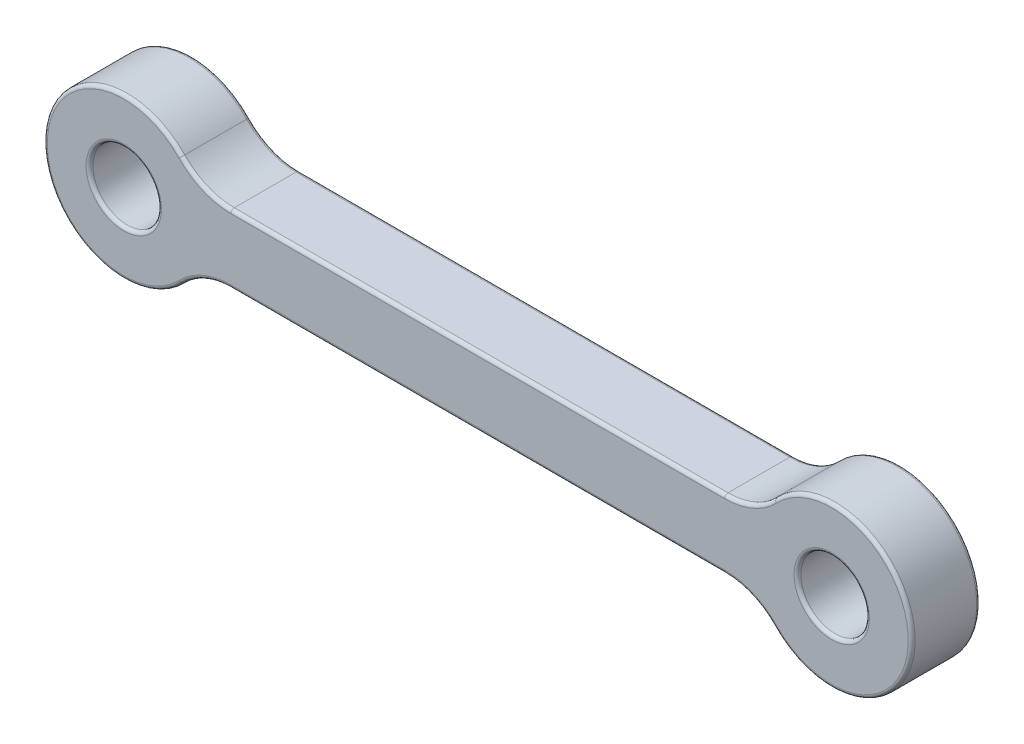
from build123d import *

# Parameters (mm, degrees)
SKETCH1_R           = 1.5
BOSS_EXTRUDE1_DEPTH = 1.5
FILLET1_R           = 3
FILLET2_R           = 0.15


with BuildPart() as part:
    # Sketch1 → Boss-Extrude1 (new, symmetric)
    with BuildSketch(Plane.XY):
        with BuildLine():
            Line((27.837722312, -1.499999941), (3.162277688, -1.499999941))
            ThreePointArc((3.162277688, -1.499999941), (-3.5, -6.6e-08), (3.162277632, 1.500000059))
            Line((3.162277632, 1.500000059), (27.837722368, 1.500000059))
            ThreePointArc((27.837722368, 1.500000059), (34.5, -6.6e-08), (27.837722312, -1.499999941))
        make_face()
        Circle(SKETCH1_R, mode=Mode.SUBTRACT)
        with Locations(Location((31, 0, 0), (0, 0, 180))):
            Circle(SKETCH1_R, mode=Mode.SUBTRACT)
    extrude(amount=BOSS_EXTRUDE1_DEPTH, both=True)

    # Fillet1
    fillet1_edges = [part.edges().sort_by_distance(p)[0] for p in [
        (27.837722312, -1.499999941, 0),
        (3.162277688, -1.499999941, 0),
        (3.162277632, 1.500000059, 0),
        (27.837722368, 1.500000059, 0),
    ]]
    fillet(fillet1_edges, radius=FILLET1_R)

    # Fillet2
    fillet2_edges = [part.edges().sort_by_distance(p)[0] for p in [
        (-1.5, 0, -1.5),
        (-1.5, 0, 1.5),
        (32.5, 0, -1.5),
        (32.5, 0, 1.5),
        (34.5, -4.4e-08, -1.5),
        (34.5, -4.4e-08, 1.5),
        (15.5, -1.499999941, -1.5),
        (15.5, -1.499999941, 1.5),
        (15.5, 1.500000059, -1.5),
        (15.5, 1.500000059, 1.5),
        (-3.5, -4.4e-08, -1.5),
        (-3.5, -4.4e-08, 1.5),
        (27.486281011, -1.740401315, -1.5),
        (27.486281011, -1.740401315, 1.5),
        (27.486281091, 1.740401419, -1.5),
        (27.486281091, 1.740401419, 1.5),
        (3.513718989, -1.740401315, -1.5),
        (3.513718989, -1.740401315, 1.5),
        (3.513718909, 1.740401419, -1.5),
        (3.513718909, 1.740401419, 1.5),
    ]]
    fillet(fillet2_edges, radius=FILLET2_R)


solid = part.part
